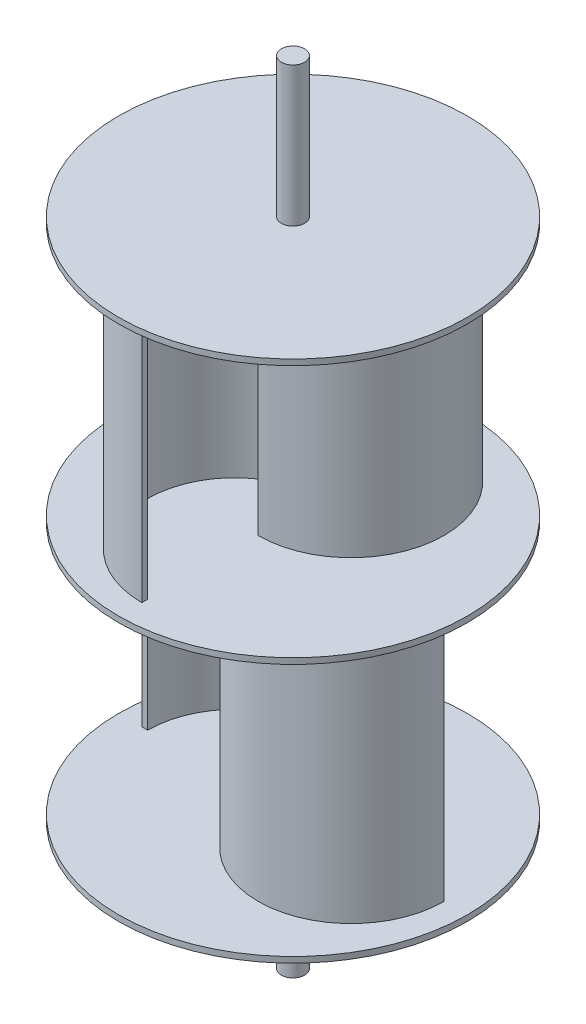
ISO-10303-21;
HEADER;
FILE_DESCRIPTION(('STEP AP214'),'2;1');
FILE_NAME('part.step','',(''),(''),'','','');
FILE_SCHEMA(('AUTOMOTIVE_DESIGN { 1 0 10303 214 1 1 1 1 }'));
ENDSEC;
DATA;
#1=APPLICATION_CONTEXT('core data for automotive mechanical design processes');
#2=APPLICATION_PROTOCOL_DEFINITION('international standard','automotive_design',2000,#1);
#3=PRODUCT_CONTEXT('',#1,'mechanical');
#4=PRODUCT('Part','Part','',(#3));
#5=PRODUCT_RELATED_PRODUCT_CATEGORY('part','',(#4));
#6=PRODUCT_DEFINITION_FORMATION('','',#4);
#7=PRODUCT_DEFINITION_CONTEXT('part definition',#1,'design');
#8=PRODUCT_DEFINITION('design','',#6,#7);
#9=PRODUCT_DEFINITION_SHAPE('','',#8);
#10=(LENGTH_UNIT() NAMED_UNIT(*) SI_UNIT(.MILLI.,.METRE.));
#11=(NAMED_UNIT(*) PLANE_ANGLE_UNIT() SI_UNIT($,.RADIAN.));
#12=(NAMED_UNIT(*) SI_UNIT($,.STERADIAN.) SOLID_ANGLE_UNIT());
#13=UNCERTAINTY_MEASURE_WITH_UNIT(LENGTH_MEASURE(1.E-05),#10,'distance_accuracy_value','');
#14=(GEOMETRIC_REPRESENTATION_CONTEXT(3) GLOBAL_UNCERTAINTY_ASSIGNED_CONTEXT((#13)) GLOBAL_UNIT_ASSIGNED_CONTEXT((#10,
#11,#12)) REPRESENTATION_CONTEXT('',''));
#15=CARTESIAN_POINT('',(0.,0.,0.));
#16=DIRECTION('',(0.,0.,1.));
#17=DIRECTION('',(1.,0.,0.));
#18=AXIS2_PLACEMENT_3D('',#15,#16,#17);
#19=CARTESIAN_POINT('',(0.,227.5,0.));
#20=DIRECTION('',(0.,1.,0.));
#21=DIRECTION('',(0.,0.,1.));
#22=AXIS2_PLACEMENT_3D('',#19,#20,#21);
#23=PLANE('',#22);
#24=CARTESIAN_POINT('',(0.,227.5,0.));
#25=DIRECTION('',(0.,1.,0.));
#26=DIRECTION('',(0.,0.,1.));
#27=AXIS2_PLACEMENT_3D('',#24,#25,#26);
#28=CIRCLE('',#27,10.);
#29=CARTESIAN_POINT('',(0.,227.5,-10.));
#30=VERTEX_POINT('',#29);
#31=EDGE_CURVE('E272',#30,#30,#28,.T.);
#32=ORIENTED_EDGE('',*,*,#31,.F.);
#33=EDGE_LOOP('',(#32));
#34=FACE_BOUND('',#33,.T.);
#35=CARTESIAN_POINT('',(0.,227.5,0.));
#36=DIRECTION('',(0.,1.,0.));
#37=DIRECTION('',(0.,0.,1.));
#38=AXIS2_PLACEMENT_3D('',#35,#36,#37);
#39=CIRCLE('',#38,150.);
#40=CARTESIAN_POINT('',(0.,227.5,150.));
#41=VERTEX_POINT('',#40);
#42=EDGE_CURVE('E269',#41,#41,#39,.T.);
#43=ORIENTED_EDGE('',*,*,#42,.T.);
#44=EDGE_LOOP('',(#43));
#45=FACE_BOUND('',#44,.T.);
#46=DIRECTION('',(0.,0.,-1.));
#47=VECTOR('',#46,1.);
#48=CARTESIAN_POINT('',(0.,227.5,-125.));
#49=LINE('',#48,#47);
#50=CARTESIAN_POINT('',(0.,227.5,-125.));
#51=VERTEX_POINT('',#50);
#52=CARTESIAN_POINT('',(0.,227.5,-130.));
#53=VERTEX_POINT('',#52);
#54=EDGE_CURVE('E252',#51,#53,#49,.T.);
#55=ORIENTED_EDGE('',*,*,#54,.T.);
#56=CARTESIAN_POINT('',(0.,227.5,-50.));
#57=DIRECTION('',(0.,1.,0.));
#58=DIRECTION('',(1.,0.,0.));
#59=AXIS2_PLACEMENT_3D('',#56,#57,#58);
#60=CIRCLE('',#59,80.);
#61=CARTESIAN_POINT('',(0.,227.5,30.));
#62=VERTEX_POINT('',#61);
#63=EDGE_CURVE('E236',#62,#53,#60,.T.);
#64=ORIENTED_EDGE('',*,*,#63,.F.);
#65=DIRECTION('',(0.,0.,-1.));
#66=VECTOR('',#65,1.);
#67=CARTESIAN_POINT('',(0.,227.5,30.));
#68=LINE('',#67,#66);
#69=CARTESIAN_POINT('',(0.,227.5,25.));
#70=VERTEX_POINT('',#69);
#71=EDGE_CURVE('E240',#62,#70,#68,.T.);
#72=ORIENTED_EDGE('',*,*,#71,.T.);
#73=CARTESIAN_POINT('',(0.,227.5,-50.));
#74=DIRECTION('',(0.,1.,0.));
#75=DIRECTION('',(0.,0.,1.));
#76=AXIS2_PLACEMENT_3D('',#73,#74,#75);
#77=CIRCLE('',#76,75.);
#78=EDGE_CURVE('E254',#70,#51,#77,.T.);
#79=ORIENTED_EDGE('',*,*,#78,.T.);
#80=EDGE_LOOP('',(#55,#64,#72,#79));
#81=FACE_BOUND('',#80,.T.);
#82=DIRECTION('',(0.,0.,1.));
#83=VECTOR('',#82,1.);
#84=CARTESIAN_POINT('',(0.,227.5,125.));
#85=LINE('',#84,#83);
#86=CARTESIAN_POINT('',(0.,227.5,125.));
#87=VERTEX_POINT('',#86);
#88=CARTESIAN_POINT('',(0.,227.5,130.));
#89=VERTEX_POINT('',#88);
#90=EDGE_CURVE('E97',#87,#89,#85,.T.);
#91=ORIENTED_EDGE('',*,*,#90,.T.);
#92=CARTESIAN_POINT('',(0.,227.5,50.));
#93=DIRECTION('',(0.,1.,0.));
#94=DIRECTION('',(1.,0.,0.));
#95=AXIS2_PLACEMENT_3D('',#92,#93,#94);
#96=CIRCLE('',#95,80.);
#97=CARTESIAN_POINT('',(0.,227.5,-30.));
#98=VERTEX_POINT('',#97);
#99=EDGE_CURVE('E227',#98,#89,#96,.T.);
#100=ORIENTED_EDGE('',*,*,#99,.F.);
#101=DIRECTION('',(0.,0.,1.));
#102=VECTOR('',#101,1.);
#103=CARTESIAN_POINT('',(0.,227.5,-30.));
#104=LINE('',#103,#102);
#105=CARTESIAN_POINT('',(0.,227.5,-25.));
#106=VERTEX_POINT('',#105);
#107=EDGE_CURVE('E210',#98,#106,#104,.T.);
#108=ORIENTED_EDGE('',*,*,#107,.T.);
#109=CARTESIAN_POINT('',(0.,227.5,50.));
#110=DIRECTION('',(0.,1.,0.));
#111=DIRECTION('',(0.,0.,1.));
#112=AXIS2_PLACEMENT_3D('',#109,#110,#111);
#113=CIRCLE('',#112,75.);
#114=EDGE_CURVE('E102',#106,#87,#113,.T.);
#115=ORIENTED_EDGE('',*,*,#114,.T.);
#116=EDGE_LOOP('',(#91,#100,#108,#115));
#117=FACE_BOUND('',#116,.T.);
#118=ADVANCED_FACE('F82',(#34,#45,#81,#117),#23,.T.);
#119=CARTESIAN_POINT('',(0.,440.,0.));
#120=DIRECTION('',(0.,-1.,0.));
#121=DIRECTION('',(0.,0.,-1.));
#122=AXIS2_PLACEMENT_3D('',#119,#120,#121);
#123=CYLINDRICAL_SURFACE('',#122,10.);
#124=CARTESIAN_POINT('',(0.,5.,0.));
#125=DIRECTION('',(0.,1.,0.));
#126=DIRECTION('',(0.,0.,1.));
#127=AXIS2_PLACEMENT_3D('',#124,#125,#126);
#128=CIRCLE('',#127,10.);
#129=CARTESIAN_POINT('',(0.,5.,-10.));
#130=VERTEX_POINT('',#129);
#131=EDGE_CURVE('E275',#130,#130,#128,.T.);
#132=CARTESIAN_POINT('',(0.,222.5,0.));
#133=DIRECTION('',(0.,1.,0.));
#134=DIRECTION('',(0.,0.,1.));
#135=AXIS2_PLACEMENT_3D('',#132,#133,#134);
#136=CIRCLE('',#135,10.);
#137=CARTESIAN_POINT('',(0.,222.5,-10.));
#138=VERTEX_POINT('',#137);
#139=EDGE_CURVE('E90',#138,#138,#136,.T.);
#140=CARTESIAN_POINT('',(0.,5.,-10.));
#141=CARTESIAN_POINT('',(0.,7.265625,-10.));
#142=CARTESIAN_POINT('',(0.,9.53124999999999,-10.));
#143=CARTESIAN_POINT('',(0.,14.0625,-10.));
#144=CARTESIAN_POINT('',(0.,16.328125,-10.));
#145=CARTESIAN_POINT('',(0.,20.859375,-10.));
#146=CARTESIAN_POINT('',(0.,23.125,-10.));
#147=CARTESIAN_POINT('',(0.,27.65625,-10.));
#148=CARTESIAN_POINT('',(0.,29.921875,-10.));
#149=CARTESIAN_POINT('',(0.,34.453125,-10.));
#150=CARTESIAN_POINT('',(0.,36.71875,-10.));
#151=CARTESIAN_POINT('',(0.,41.25,-10.));
#152=CARTESIAN_POINT('',(0.,43.515625,-10.));
#153=CARTESIAN_POINT('',(0.,48.046875,-10.));
#154=CARTESIAN_POINT('',(0.,50.3125,-10.));
#155=CARTESIAN_POINT('',(0.,54.84375,-10.));
#156=CARTESIAN_POINT('',(0.,57.109375,-10.));
#157=CARTESIAN_POINT('',(0.,61.640625,-10.));
#158=CARTESIAN_POINT('',(0.,63.90625,-10.));
#159=CARTESIAN_POINT('',(0.,68.4375,-10.));
#160=CARTESIAN_POINT('',(0.,70.703125,-10.));
#161=CARTESIAN_POINT('',(0.,75.234375,-10.));
#162=CARTESIAN_POINT('',(0.,77.5,-10.));
#163=CARTESIAN_POINT('',(0.,82.03125,-10.));
#164=CARTESIAN_POINT('',(0.,84.296875,-10.));
#165=CARTESIAN_POINT('',(0.,88.828125,-10.));
#166=CARTESIAN_POINT('',(0.,91.09375,-10.));
#167=CARTESIAN_POINT('',(0.,95.625,-10.));
#168=CARTESIAN_POINT('',(0.,97.890625,-10.));
#169=CARTESIAN_POINT('',(0.,102.421875,-10.));
#170=CARTESIAN_POINT('',(0.,104.6875,-10.));
#171=CARTESIAN_POINT('',(0.,109.21875,-10.));
#172=CARTESIAN_POINT('',(0.,111.484375,-10.));
#173=CARTESIAN_POINT('',(0.,116.015625,-10.));
#174=CARTESIAN_POINT('',(0.,118.28125,-10.));
#175=CARTESIAN_POINT('',(0.,122.8125,-10.));
#176=CARTESIAN_POINT('',(0.,125.078125,-10.));
#177=CARTESIAN_POINT('',(0.,129.609375,-10.));
#178=CARTESIAN_POINT('',(0.,131.875,-10.));
#179=CARTESIAN_POINT('',(0.,136.40625,-10.));
#180=CARTESIAN_POINT('',(0.,138.671875,-10.));
#181=CARTESIAN_POINT('',(0.,143.203125,-10.));
#182=CARTESIAN_POINT('',(0.,145.46875,-10.));
#183=CARTESIAN_POINT('',(0.,150.,-10.));
#184=CARTESIAN_POINT('',(0.,152.265625,-10.));
#185=CARTESIAN_POINT('',(0.,156.796875,-10.));
#186=CARTESIAN_POINT('',(0.,159.0625,-10.));
#187=CARTESIAN_POINT('',(0.,163.59375,-10.));
#188=CARTESIAN_POINT('',(0.,165.859375,-10.));
#189=CARTESIAN_POINT('',(0.,170.390625,-10.));
#190=CARTESIAN_POINT('',(0.,172.65625,-10.));
#191=CARTESIAN_POINT('',(0.,177.1875,-10.));
#192=CARTESIAN_POINT('',(0.,179.453125,-10.));
#193=CARTESIAN_POINT('',(0.,183.984375,-10.));
#194=CARTESIAN_POINT('',(0.,186.25,-10.));
#195=CARTESIAN_POINT('',(0.,190.78125,-10.));
#196=CARTESIAN_POINT('',(0.,193.046875,-10.));
#197=CARTESIAN_POINT('',(0.,197.578125,-10.));
#198=CARTESIAN_POINT('',(0.,199.84375,-10.));
#199=CARTESIAN_POINT('',(0.,204.375,-10.));
#200=CARTESIAN_POINT('',(0.,206.640625,-10.));
#201=CARTESIAN_POINT('',(0.,211.171875,-10.));
#202=CARTESIAN_POINT('',(0.,213.4375,-10.));
#203=CARTESIAN_POINT('',(0.,217.96875,-10.));
#204=CARTESIAN_POINT('',(0.,220.234375,-10.));
#205=CARTESIAN_POINT('',(0.,222.5,-10.));
#206=B_SPLINE_CURVE_WITH_KNOTS('',3,(#140,#141,#142,#143,#144,#145,#146,#147,#148,#149,#150,
#151,#152,#153,#154,#155,#156,#157,#158,#159,#160,#161,#162,#163,#164,#165,#166,#167,#168,#169,
#170,#171,#172,#173,#174,#175,#176,#177,#178,#179,#180,#181,#182,#183,#184,#185,#186,#187,#188,
#189,#190,#191,#192,#193,#194,#195,#196,#197,#198,#199,#200,#201,#202,#203,#204,#205),
.UNSPECIFIED.,.F.,.F.,(4,2,2,2,2,2,2,2,2,2,2,2,2,2,2,2,2,2,2,2,2,2,2,2,2,2,2,2,2,2,2,2,4),(0.,
6.79687499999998,13.59375,20.390625,27.1875,33.984375,40.78125,47.578125,54.375,61.171875,
67.96875,74.765625,81.5625,88.359375,95.15625,101.953125,108.75,115.546875,122.34375,129.140625,
135.9375,142.734375,149.53125,156.328125,163.125,169.921875,176.71875,183.515625,190.3125,
197.109375,203.90625,210.703125,217.5),.UNSPECIFIED.);
#207=EDGE_CURVE('BSEAM357',#130,#138,#206,.T.);
#208=ORIENTED_EDGE('',*,*,#131,.T.);
#209=ORIENTED_EDGE('',*,*,#139,.F.);
#210=ORIENTED_EDGE('',*,*,#207,.T.);
#211=ORIENTED_EDGE('',*,*,#207,.F.);
#212=EDGE_LOOP('',(#208,#210,#209,#211));
#213=FACE_BOUND('',#212,.T.);
#214=ADVANCED_FACE('F357',(#213),#123,.T.);
#215=CARTESIAN_POINT('',(0.,5.,0.));
#216=DIRECTION('',(0.,1.,0.));
#217=DIRECTION('',(0.,0.,1.));
#218=AXIS2_PLACEMENT_3D('',#215,#216,#217);
#219=PLANE('',#218);
#220=ORIENTED_EDGE('',*,*,#131,.F.);
#221=EDGE_LOOP('',(#220));
#222=FACE_BOUND('',#221,.T.);
#223=CARTESIAN_POINT('',(0.,5.,0.));
#224=DIRECTION('',(0.,1.,0.));
#225=DIRECTION('',(0.,0.,1.));
#226=AXIS2_PLACEMENT_3D('',#223,#224,#225);
#227=CIRCLE('',#226,150.);
#228=CARTESIAN_POINT('',(0.,5.,150.));
#229=VERTEX_POINT('',#228);
#230=EDGE_CURVE('E343',#229,#229,#227,.T.);
#231=ORIENTED_EDGE('',*,*,#230,.T.);
#232=EDGE_LOOP('',(#231));
#233=FACE_BOUND('',#232,.T.);
#234=DIRECTION('',(-1.,0.,0.));
#235=VECTOR('',#234,1.);
#236=CARTESIAN_POINT('',(-125.,5.,0.));
#237=LINE('',#236,#235);
#238=CARTESIAN_POINT('',(-125.,5.,0.));
#239=VERTEX_POINT('',#238);
#240=CARTESIAN_POINT('',(-130.,5.,0.));
#241=VERTEX_POINT('',#240);
#242=EDGE_CURVE('E326',#239,#241,#237,.T.);
#243=ORIENTED_EDGE('',*,*,#242,.T.);
#244=CARTESIAN_POINT('',(-50.,5.,0.));
#245=DIRECTION('',(0.,1.,0.));
#246=DIRECTION('',(1.,0.,0.));
#247=AXIS2_PLACEMENT_3D('',#244,#245,#246);
#248=CIRCLE('',#247,80.);
#249=CARTESIAN_POINT('',(30.,5.,0.));
#250=VERTEX_POINT('',#249);
#251=EDGE_CURVE('E301',#250,#241,#248,.T.);
#252=ORIENTED_EDGE('',*,*,#251,.F.);
#253=DIRECTION('',(-1.,0.,0.));
#254=VECTOR('',#253,1.);
#255=CARTESIAN_POINT('',(30.,5.,0.));
#256=LINE('',#255,#254);
#257=CARTESIAN_POINT('',(25.,5.,0.));
#258=VERTEX_POINT('',#257);
#259=EDGE_CURVE('E314',#250,#258,#256,.T.);
#260=ORIENTED_EDGE('',*,*,#259,.T.);
#261=CARTESIAN_POINT('',(-50.,5.,0.));
#262=DIRECTION('',(0.,1.,0.));
#263=DIRECTION('',(0.,0.,1.));
#264=AXIS2_PLACEMENT_3D('',#261,#262,#263);
#265=CIRCLE('',#264,75.);
#266=EDGE_CURVE('E328',#258,#239,#265,.T.);
#267=ORIENTED_EDGE('',*,*,#266,.T.);
#268=EDGE_LOOP('',(#243,#252,#260,#267));
#269=FACE_BOUND('',#268,.T.);
#270=DIRECTION('',(1.,0.,0.));
#271=VECTOR('',#270,1.);
#272=CARTESIAN_POINT('',(125.,5.,0.));
#273=LINE('',#272,#271);
#274=CARTESIAN_POINT('',(125.,5.,0.));
#275=VERTEX_POINT('',#274);
#276=CARTESIAN_POINT('',(130.,5.,0.));
#277=VERTEX_POINT('',#276);
#278=EDGE_CURVE('E296',#275,#277,#273,.T.);
#279=ORIENTED_EDGE('',*,*,#278,.T.);
#280=CARTESIAN_POINT('',(50.,5.,0.));
#281=DIRECTION('',(0.,1.,0.));
#282=DIRECTION('',(1.,0.,0.));
#283=AXIS2_PLACEMENT_3D('',#280,#281,#282);
#284=CIRCLE('',#283,80.);
#285=CARTESIAN_POINT('',(-30.,5.,0.));
#286=VERTEX_POINT('',#285);
#287=EDGE_CURVE('E298',#286,#277,#284,.T.);
#288=ORIENTED_EDGE('',*,*,#287,.F.);
#289=DIRECTION('',(1.,0.,0.));
#290=VECTOR('',#289,1.);
#291=CARTESIAN_POINT('',(-30.,5.,0.));
#292=LINE('',#291,#290);
#293=CARTESIAN_POINT('',(-25.,5.,0.));
#294=VERTEX_POINT('',#293);
#295=EDGE_CURVE('E291',#286,#294,#292,.T.);
#296=ORIENTED_EDGE('',*,*,#295,.T.);
#297=CARTESIAN_POINT('',(50.,5.,0.));
#298=DIRECTION('',(0.,1.,0.));
#299=DIRECTION('',(0.,0.,1.));
#300=AXIS2_PLACEMENT_3D('',#297,#298,#299);
#301=CIRCLE('',#300,75.);
#302=EDGE_CURVE('E293',#294,#275,#301,.T.);
#303=ORIENTED_EDGE('',*,*,#302,.T.);
#304=EDGE_LOOP('',(#279,#288,#296,#303));
#305=FACE_BOUND('',#304,.T.);
#306=ADVANCED_FACE('F455',(#222,#233,#269,#305),#219,.T.);
#307=CARTESIAN_POINT('',(0.,5.,0.));
#308=DIRECTION('',(0.,-1.,0.));
#309=DIRECTION('',(0.,0.,-1.));
#310=AXIS2_PLACEMENT_3D('',#307,#308,#309);
#311=CYLINDRICAL_SURFACE('',#310,150.);
#312=ORIENTED_EDGE('',*,*,#230,.F.);
#313=EDGE_LOOP('',(#312));
#314=FACE_BOUND('',#313,.T.);
#315=CARTESIAN_POINT('',(0.,0.,0.));
#316=DIRECTION('',(0.,1.,0.));
#317=DIRECTION('',(0.,0.,1.));
#318=AXIS2_PLACEMENT_3D('',#315,#316,#317);
#319=CIRCLE('',#318,150.);
#320=CARTESIAN_POINT('',(0.,0.,150.));
#321=VERTEX_POINT('',#320);
#322=EDGE_CURVE('E342',#321,#321,#319,.T.);
#323=ORIENTED_EDGE('',*,*,#322,.T.);
#324=EDGE_LOOP('',(#323));
#325=FACE_BOUND('',#324,.T.);
#326=ADVANCED_FACE('F84',(#314,#325),#311,.T.);
#327=CARTESIAN_POINT('',(0.,0.,0.));
#328=DIRECTION('',(0.,1.,0.));
#329=DIRECTION('',(0.,0.,1.));
#330=AXIS2_PLACEMENT_3D('',#327,#328,#329);
#331=PLANE('',#330);
#332=CARTESIAN_POINT('',(0.,0.,0.));
#333=DIRECTION('',(0.,1.,0.));
#334=DIRECTION('',(0.,0.,1.));
#335=AXIS2_PLACEMENT_3D('',#332,#333,#334);
#336=CIRCLE('',#335,10.);
#337=CARTESIAN_POINT('',(0.,0.,10.));
#338=VERTEX_POINT('',#337);
#339=EDGE_CURVE('E467',#338,#338,#336,.T.);
#340=ORIENTED_EDGE('',*,*,#339,.T.);
#341=EDGE_LOOP('',(#340));
#342=FACE_BOUND('',#341,.T.);
#343=ORIENTED_EDGE('',*,*,#322,.F.);
#344=EDGE_LOOP('',(#343));
#345=FACE_BOUND('',#344,.T.);
#346=ADVANCED_FACE('F453',(#342,#345),#331,.F.);
#347=CARTESIAN_POINT('',(-50.,222.5,0.));
#348=DIRECTION('',(0.,-1.,0.));
#349=DIRECTION('',(0.,0.,-1.));
#350=AXIS2_PLACEMENT_3D('',#347,#348,#349);
#351=CYLINDRICAL_SURFACE('',#350,80.);
#352=ORIENTED_EDGE('',*,*,#251,.T.);
#353=DIRECTION('',(0.,-1.,0.));
#354=VECTOR('',#353,1.);
#355=CARTESIAN_POINT('',(-130.,222.5,0.));
#356=LINE('',#355,#354);
#357=CARTESIAN_POINT('',(-130.,222.5,0.));
#358=VERTEX_POINT('',#357);
#359=EDGE_CURVE('E339',#358,#241,#356,.T.);
#360=ORIENTED_EDGE('',*,*,#359,.F.);
#361=CARTESIAN_POINT('',(-50.,222.5,0.));
#362=DIRECTION('',(0.,1.,0.));
#363=DIRECTION('',(1.,0.,0.));
#364=AXIS2_PLACEMENT_3D('',#361,#362,#363);
#365=CIRCLE('',#364,80.);
#366=CARTESIAN_POINT('',(30.,222.5,0.));
#367=VERTEX_POINT('',#366);
#368=EDGE_CURVE('E311',#367,#358,#365,.T.);
#369=ORIENTED_EDGE('',*,*,#368,.F.);
#370=DIRECTION('',(0.,-1.,0.));
#371=VECTOR('',#370,1.);
#372=CARTESIAN_POINT('',(30.,222.5,0.));
#373=LINE('',#372,#371);
#374=EDGE_CURVE('E323',#367,#250,#373,.T.);
#375=ORIENTED_EDGE('',*,*,#374,.T.);
#376=EDGE_LOOP('',(#352,#360,#369,#375));
#377=FACE_BOUND('',#376,.T.);
#378=ADVANCED_FACE('F449',(#377),#351,.T.);
#379=CARTESIAN_POINT('',(-125.,222.5,0.));
#380=DIRECTION('',(0.,0.,1.));
#381=DIRECTION('',(1.,0.,0.));
#382=AXIS2_PLACEMENT_3D('',#379,#380,#381);
#383=PLANE('',#382);
#384=ORIENTED_EDGE('',*,*,#242,.F.);
#385=DIRECTION('',(0.,-1.,0.));
#386=VECTOR('',#385,1.);
#387=CARTESIAN_POINT('',(-125.,222.5,0.));
#388=LINE('',#387,#386);
#389=CARTESIAN_POINT('',(-125.,222.5,0.));
#390=VERTEX_POINT('',#389);
#391=EDGE_CURVE('E336',#390,#239,#388,.T.);
#392=ORIENTED_EDGE('',*,*,#391,.F.);
#393=DIRECTION('',(-1.,0.,0.));
#394=VECTOR('',#393,1.);
#395=CARTESIAN_POINT('',(-125.,222.5,0.));
#396=LINE('',#395,#394);
#397=EDGE_CURVE('E313',#390,#358,#396,.T.);
#398=ORIENTED_EDGE('',*,*,#397,.T.);
#399=ORIENTED_EDGE('',*,*,#359,.T.);
#400=EDGE_LOOP('',(#384,#392,#398,#399));
#401=FACE_BOUND('',#400,.T.);
#402=ADVANCED_FACE('F445',(#401),#383,.T.);
#403=CARTESIAN_POINT('',(-50.,222.5,0.));
#404=DIRECTION('',(0.,-1.,0.));
#405=DIRECTION('',(0.,0.,-1.));
#406=AXIS2_PLACEMENT_3D('',#403,#404,#405);
#407=CYLINDRICAL_SURFACE('',#406,75.);
#408=ORIENTED_EDGE('',*,*,#266,.F.);
#409=DIRECTION('',(0.,-1.,0.));
#410=VECTOR('',#409,1.);
#411=CARTESIAN_POINT('',(25.,222.5,0.));
#412=LINE('',#411,#410);
#413=CARTESIAN_POINT('',(25.,222.5,0.));
#414=VERTEX_POINT('',#413);
#415=EDGE_CURVE('E333',#414,#258,#412,.T.);
#416=ORIENTED_EDGE('',*,*,#415,.F.);
#417=CARTESIAN_POINT('',(-50.,222.5,0.));
#418=DIRECTION('',(0.,1.,0.));
#419=DIRECTION('',(0.,0.,1.));
#420=AXIS2_PLACEMENT_3D('',#417,#418,#419);
#421=CIRCLE('',#420,75.);
#422=EDGE_CURVE('E317',#414,#390,#421,.T.);
#423=ORIENTED_EDGE('',*,*,#422,.T.);
#424=ORIENTED_EDGE('',*,*,#391,.T.);
#425=EDGE_LOOP('',(#408,#416,#423,#424));
#426=FACE_BOUND('',#425,.T.);
#427=ADVANCED_FACE('F441',(#426),#407,.F.);
#428=CARTESIAN_POINT('',(30.,222.5,0.));
#429=DIRECTION('',(0.,0.,1.));
#430=DIRECTION('',(1.,0.,0.));
#431=AXIS2_PLACEMENT_3D('',#428,#429,#430);
#432=PLANE('',#431);
#433=ORIENTED_EDGE('',*,*,#259,.F.);
#434=ORIENTED_EDGE('',*,*,#374,.F.);
#435=DIRECTION('',(-1.,0.,0.));
#436=VECTOR('',#435,1.);
#437=CARTESIAN_POINT('',(30.,222.5,0.));
#438=LINE('',#437,#436);
#439=EDGE_CURVE('E320',#367,#414,#438,.T.);
#440=ORIENTED_EDGE('',*,*,#439,.T.);
#441=ORIENTED_EDGE('',*,*,#415,.T.);
#442=EDGE_LOOP('',(#433,#434,#440,#441));
#443=FACE_BOUND('',#442,.T.);
#444=ADVANCED_FACE('F427',(#443),#432,.T.);
#445=CARTESIAN_POINT('',(50.,222.5,0.));
#446=DIRECTION('',(0.,-1.,0.));
#447=DIRECTION('',(0.,0.,-1.));
#448=AXIS2_PLACEMENT_3D('',#445,#446,#447);
#449=CYLINDRICAL_SURFACE('',#448,80.);
#450=ORIENTED_EDGE('',*,*,#287,.T.);
#451=DIRECTION('',(0.,-1.,0.));
#452=VECTOR('',#451,1.);
#453=CARTESIAN_POINT('',(130.,222.5,0.));
#454=LINE('',#453,#452);
#455=CARTESIAN_POINT('',(130.,222.5,0.));
#456=VERTEX_POINT('',#455);
#457=EDGE_CURVE('E278',#456,#277,#454,.T.);
#458=ORIENTED_EDGE('',*,*,#457,.F.);
#459=CARTESIAN_POINT('',(50.,222.5,0.));
#460=DIRECTION('',(0.,1.,0.));
#461=DIRECTION('',(1.,0.,0.));
#462=AXIS2_PLACEMENT_3D('',#459,#460,#461);
#463=CIRCLE('',#462,80.);
#464=CARTESIAN_POINT('',(-30.,222.5,0.));
#465=VERTEX_POINT('',#464);
#466=EDGE_CURVE('E294',#465,#456,#463,.T.);
#467=ORIENTED_EDGE('',*,*,#466,.F.);
#468=DIRECTION('',(0.,-1.,0.));
#469=VECTOR('',#468,1.);
#470=CARTESIAN_POINT('',(-30.,222.5,0.));
#471=LINE('',#470,#469);
#472=EDGE_CURVE('E287',#465,#286,#471,.T.);
#473=ORIENTED_EDGE('',*,*,#472,.T.);
#474=EDGE_LOOP('',(#450,#458,#467,#473));
#475=FACE_BOUND('',#474,.T.);
#476=ADVANCED_FACE('F423',(#475),#449,.T.);
#477=CARTESIAN_POINT('',(125.,222.5,0.));
#478=DIRECTION('',(0.,0.,-1.));
#479=DIRECTION('',(-1.,0.,0.));
#480=AXIS2_PLACEMENT_3D('',#477,#478,#479);
#481=PLANE('',#480);
#482=ORIENTED_EDGE('',*,*,#278,.F.);
#483=DIRECTION('',(0.,-1.,0.));
#484=VECTOR('',#483,1.);
#485=CARTESIAN_POINT('',(125.,222.5,0.));
#486=LINE('',#485,#484);
#487=CARTESIAN_POINT('',(125.,222.5,0.));
#488=VERTEX_POINT('',#487);
#489=EDGE_CURVE('E281',#488,#275,#486,.T.);
#490=ORIENTED_EDGE('',*,*,#489,.F.);
#491=DIRECTION('',(1.,0.,0.));
#492=VECTOR('',#491,1.);
#493=CARTESIAN_POINT('',(125.,222.5,0.));
#494=LINE('',#493,#492);
#495=EDGE_CURVE('E307',#488,#456,#494,.T.);
#496=ORIENTED_EDGE('',*,*,#495,.T.);
#497=ORIENTED_EDGE('',*,*,#457,.T.);
#498=EDGE_LOOP('',(#482,#490,#496,#497));
#499=FACE_BOUND('',#498,.T.);
#500=ADVANCED_FACE('F426',(#499),#481,.T.);
#501=CARTESIAN_POINT('',(50.,222.5,0.));
#502=DIRECTION('',(0.,-1.,0.));
#503=DIRECTION('',(0.,0.,-1.));
#504=AXIS2_PLACEMENT_3D('',#501,#502,#503);
#505=CYLINDRICAL_SURFACE('',#504,75.);
#506=ORIENTED_EDGE('',*,*,#302,.F.);
#507=DIRECTION('',(0.,-1.,0.));
#508=VECTOR('',#507,1.);
#509=CARTESIAN_POINT('',(-25.,222.5,0.));
#510=LINE('',#509,#508);
#511=CARTESIAN_POINT('',(-25.,222.5,0.));
#512=VERTEX_POINT('',#511);
#513=EDGE_CURVE('E284',#512,#294,#510,.T.);
#514=ORIENTED_EDGE('',*,*,#513,.F.);
#515=CARTESIAN_POINT('',(50.,222.5,0.));
#516=DIRECTION('',(0.,1.,0.));
#517=DIRECTION('',(0.,0.,1.));
#518=AXIS2_PLACEMENT_3D('',#515,#516,#517);
#519=CIRCLE('',#518,75.);
#520=EDGE_CURVE('E304',#512,#488,#519,.T.);
#521=ORIENTED_EDGE('',*,*,#520,.T.);
#522=ORIENTED_EDGE('',*,*,#489,.T.);
#523=EDGE_LOOP('',(#506,#514,#521,#522));
#524=FACE_BOUND('',#523,.T.);
#525=ADVANCED_FACE('F431',(#524),#505,.F.);
#526=CARTESIAN_POINT('',(-30.,222.5,0.));
#527=DIRECTION('',(0.,0.,-1.));
#528=DIRECTION('',(-1.,0.,0.));
#529=AXIS2_PLACEMENT_3D('',#526,#527,#528);
#530=PLANE('',#529);
#531=ORIENTED_EDGE('',*,*,#295,.F.);
#532=ORIENTED_EDGE('',*,*,#472,.F.);
#533=DIRECTION('',(1.,0.,0.));
#534=VECTOR('',#533,1.);
#535=CARTESIAN_POINT('',(-30.,222.5,0.));
#536=LINE('',#535,#534);
#537=EDGE_CURVE('E290',#465,#512,#536,.T.);
#538=ORIENTED_EDGE('',*,*,#537,.T.);
#539=ORIENTED_EDGE('',*,*,#513,.T.);
#540=EDGE_LOOP('',(#531,#532,#538,#539));
#541=FACE_BOUND('',#540,.T.);
#542=ADVANCED_FACE('F419',(#541),#530,.T.);
#543=CARTESIAN_POINT('',(0.,227.5,0.));
#544=DIRECTION('',(0.,-1.,0.));
#545=DIRECTION('',(0.,0.,-1.));
#546=AXIS2_PLACEMENT_3D('',#543,#544,#545);
#547=CYLINDRICAL_SURFACE('',#546,150.);
#548=ORIENTED_EDGE('',*,*,#42,.F.);
#549=EDGE_LOOP('',(#548));
#550=FACE_BOUND('',#549,.T.);
#551=CARTESIAN_POINT('',(0.,222.5,0.));
#552=DIRECTION('',(0.,1.,0.));
#553=DIRECTION('',(0.,0.,1.));
#554=AXIS2_PLACEMENT_3D('',#551,#552,#553);
#555=CIRCLE('',#554,150.);
#556=CARTESIAN_POINT('',(0.,222.5,150.));
#557=VERTEX_POINT('',#556);
#558=EDGE_CURVE('E268',#557,#557,#555,.T.);
#559=ORIENTED_EDGE('',*,*,#558,.T.);
#560=EDGE_LOOP('',(#559));
#561=FACE_BOUND('',#560,.T.);
#562=ADVANCED_FACE('F415',(#550,#561),#547,.T.);
#563=CARTESIAN_POINT('',(0.,222.5,0.));
#564=DIRECTION('',(0.,1.,0.));
#565=DIRECTION('',(0.,0.,1.));
#566=AXIS2_PLACEMENT_3D('',#563,#564,#565);
#567=PLANE('',#566);
#568=ORIENTED_EDGE('',*,*,#439,.F.);
#569=ORIENTED_EDGE('',*,*,#368,.T.);
#570=ORIENTED_EDGE('',*,*,#397,.F.);
#571=ORIENTED_EDGE('',*,*,#422,.F.);
#572=EDGE_LOOP('',(#568,#569,#570,#571));
#573=FACE_BOUND('',#572,.T.);
#574=ORIENTED_EDGE('',*,*,#537,.F.);
#575=ORIENTED_EDGE('',*,*,#466,.T.);
#576=ORIENTED_EDGE('',*,*,#495,.F.);
#577=ORIENTED_EDGE('',*,*,#520,.F.);
#578=EDGE_LOOP('',(#574,#575,#576,#577));
#579=FACE_BOUND('',#578,.T.);
#580=ORIENTED_EDGE('',*,*,#139,.T.);
#581=EDGE_LOOP('',(#580));
#582=FACE_BOUND('',#581,.T.);
#583=ORIENTED_EDGE('',*,*,#558,.F.);
#584=EDGE_LOOP('',(#583));
#585=FACE_BOUND('',#584,.T.);
#586=ADVANCED_FACE('F412',(#573,#579,#582,#585),#567,.F.);
#587=CARTESIAN_POINT('',(0.,445.,0.));
#588=DIRECTION('',(0.,1.,0.));
#589=DIRECTION('',(0.,0.,1.));
#590=AXIS2_PLACEMENT_3D('',#587,#588,#589);
#591=CIRCLE('',#590,10.);
#592=CARTESIAN_POINT('',(0.,445.,-10.));
#593=VERTEX_POINT('',#592);
#594=EDGE_CURVE('E471',#593,#593,#591,.T.);
#595=CARTESIAN_POINT('',(0.,227.5,-10.));
#596=CARTESIAN_POINT('',(0.,229.765625,-10.));
#597=CARTESIAN_POINT('',(0.,232.03125,-10.));
#598=CARTESIAN_POINT('',(0.,236.5625,-10.));
#599=CARTESIAN_POINT('',(0.,238.828125,-10.));
#600=CARTESIAN_POINT('',(0.,243.359375,-10.));
#601=CARTESIAN_POINT('',(0.,245.625,-10.));
#602=CARTESIAN_POINT('',(0.,250.15625,-10.));
#603=CARTESIAN_POINT('',(0.,252.421875,-10.));
#604=CARTESIAN_POINT('',(0.,256.953125,-10.));
#605=CARTESIAN_POINT('',(0.,259.21875,-10.));
#606=CARTESIAN_POINT('',(0.,263.75,-10.));
#607=CARTESIAN_POINT('',(0.,266.015625,-10.));
#608=CARTESIAN_POINT('',(0.,270.546875,-10.));
#609=CARTESIAN_POINT('',(0.,272.8125,-10.));
#610=CARTESIAN_POINT('',(0.,277.34375,-10.));
#611=CARTESIAN_POINT('',(0.,279.609375,-10.));
#612=CARTESIAN_POINT('',(0.,284.140625,-10.));
#613=CARTESIAN_POINT('',(0.,286.40625,-10.));
#614=CARTESIAN_POINT('',(0.,290.9375,-10.));
#615=CARTESIAN_POINT('',(0.,293.203125,-10.));
#616=CARTESIAN_POINT('',(0.,297.734375,-10.));
#617=CARTESIAN_POINT('',(0.,300.,-10.));
#618=CARTESIAN_POINT('',(0.,304.53125,-10.));
#619=CARTESIAN_POINT('',(0.,306.796875,-10.));
#620=CARTESIAN_POINT('',(0.,311.328125,-10.));
#621=CARTESIAN_POINT('',(0.,313.59375,-10.));
#622=CARTESIAN_POINT('',(0.,318.125,-10.));
#623=CARTESIAN_POINT('',(0.,320.390625,-10.));
#624=CARTESIAN_POINT('',(0.,324.921875,-10.));
#625=CARTESIAN_POINT('',(0.,327.1875,-10.));
#626=CARTESIAN_POINT('',(0.,331.71875,-10.));
#627=CARTESIAN_POINT('',(0.,333.984375,-10.));
#628=CARTESIAN_POINT('',(0.,338.515625,-10.));
#629=CARTESIAN_POINT('',(0.,340.78125,-10.));
#630=CARTESIAN_POINT('',(0.,345.3125,-10.));
#631=CARTESIAN_POINT('',(0.,347.578125,-10.));
#632=CARTESIAN_POINT('',(0.,352.109375,-10.));
#633=CARTESIAN_POINT('',(0.,354.375,-10.));
#634=CARTESIAN_POINT('',(0.,358.90625,-10.));
#635=CARTESIAN_POINT('',(0.,361.171875,-10.));
#636=CARTESIAN_POINT('',(0.,365.703125,-10.));
#637=CARTESIAN_POINT('',(0.,367.96875,-10.));
#638=CARTESIAN_POINT('',(0.,372.5,-10.));
#639=CARTESIAN_POINT('',(0.,374.765625,-10.));
#640=CARTESIAN_POINT('',(0.,379.296875,-10.));
#641=CARTESIAN_POINT('',(0.,381.5625,-10.));
#642=CARTESIAN_POINT('',(0.,386.09375,-10.));
#643=CARTESIAN_POINT('',(0.,388.359375,-10.));
#644=CARTESIAN_POINT('',(0.,392.890625,-10.));
#645=CARTESIAN_POINT('',(0.,395.15625,-10.));
#646=CARTESIAN_POINT('',(0.,399.6875,-10.));
#647=CARTESIAN_POINT('',(0.,401.953125,-10.));
#648=CARTESIAN_POINT('',(0.,406.484375,-10.));
#649=CARTESIAN_POINT('',(0.,408.75,-10.));
#650=CARTESIAN_POINT('',(0.,413.28125,-10.));
#651=CARTESIAN_POINT('',(0.,415.546875,-10.));
#652=CARTESIAN_POINT('',(0.,420.078125,-10.));
#653=CARTESIAN_POINT('',(0.,422.34375,-10.));
#654=CARTESIAN_POINT('',(0.,426.875,-10.));
#655=CARTESIAN_POINT('',(0.,429.140625,-10.));
#656=CARTESIAN_POINT('',(0.,433.671875,-10.));
#657=CARTESIAN_POINT('',(0.,435.9375,-10.));
#658=CARTESIAN_POINT('',(0.,440.46875,-10.));
#659=CARTESIAN_POINT('',(0.,442.734375,-10.));
#660=CARTESIAN_POINT('',(0.,445.,-10.));
#661=B_SPLINE_CURVE_WITH_KNOTS('',3,(#595,#596,#597,#598,#599,#600,#601,#602,#603,#604,#605,
#606,#607,#608,#609,#610,#611,#612,#613,#614,#615,#616,#617,#618,#619,#620,#621,#622,#623,#624,
#625,#626,#627,#628,#629,#630,#631,#632,#633,#634,#635,#636,#637,#638,#639,#640,#641,#642,#643,
#644,#645,#646,#647,#648,#649,#650,#651,#652,#653,#654,#655,#656,#657,#658,#659,#660),
.UNSPECIFIED.,.F.,.F.,(4,2,2,2,2,2,2,2,2,2,2,2,2,2,2,2,2,2,2,2,2,2,2,2,2,2,2,2,2,2,2,2,4),(0.,
6.79687500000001,13.59375,20.390625,27.1875,33.984375,40.78125,47.578125,54.375,61.171875,
67.96875,74.765625,81.5625,88.359375,95.15625,101.953125,108.75,115.546875,122.34375,129.140625,
135.9375,142.734375,149.53125,156.328125,163.125,169.921875,176.71875,183.515625,190.3125,
197.109375,203.90625,210.703125,217.5),.UNSPECIFIED.);
#662=EDGE_CURVE('BSEAM352',#30,#593,#661,.T.);
#663=ORIENTED_EDGE('',*,*,#31,.T.);
#664=ORIENTED_EDGE('',*,*,#594,.F.);
#665=ORIENTED_EDGE('',*,*,#662,.T.);
#666=ORIENTED_EDGE('',*,*,#662,.F.);
#667=EDGE_LOOP('',(#663,#665,#664,#666));
#668=FACE_BOUND('',#667,.T.);
#669=ADVANCED_FACE('F352',(#668),#123,.T.);
#670=CARTESIAN_POINT('',(0.,445.,-50.));
#671=DIRECTION('',(0.,-1.,0.));
#672=DIRECTION('',(0.,0.,-1.));
#673=AXIS2_PLACEMENT_3D('',#670,#671,#672);
#674=CYLINDRICAL_SURFACE('',#673,80.);
#675=ORIENTED_EDGE('',*,*,#63,.T.);
#676=DIRECTION('',(0.,-1.,0.));
#677=VECTOR('',#676,1.);
#678=CARTESIAN_POINT('',(0.,445.,-130.));
#679=LINE('',#678,#677);
#680=CARTESIAN_POINT('',(0.,445.,-130.));
#681=VERTEX_POINT('',#680);
#682=EDGE_CURVE('E265',#681,#53,#679,.T.);
#683=ORIENTED_EDGE('',*,*,#682,.F.);
#684=CARTESIAN_POINT('',(0.,445.,-50.));
#685=DIRECTION('',(0.,1.,0.));
#686=DIRECTION('',(1.,0.,0.));
#687=AXIS2_PLACEMENT_3D('',#684,#685,#686);
#688=CIRCLE('',#687,80.);
#689=CARTESIAN_POINT('',(0.,445.,30.));
#690=VERTEX_POINT('',#689);
#691=EDGE_CURVE('E237',#690,#681,#688,.T.);
#692=ORIENTED_EDGE('',*,*,#691,.F.);
#693=DIRECTION('',(0.,-1.,0.));
#694=VECTOR('',#693,1.);
#695=CARTESIAN_POINT('',(0.,445.,30.));
#696=LINE('',#695,#694);
#697=EDGE_CURVE('E249',#690,#62,#696,.T.);
#698=ORIENTED_EDGE('',*,*,#697,.T.);
#699=EDGE_LOOP('',(#675,#683,#692,#698));
#700=FACE_BOUND('',#699,.T.);
#701=ADVANCED_FACE('F369',(#700),#674,.T.);
#702=CARTESIAN_POINT('',(0.,445.,-125.));
#703=DIRECTION('',(-1.,0.,0.));
#704=DIRECTION('',(0.,0.,1.));
#705=AXIS2_PLACEMENT_3D('',#702,#703,#704);
#706=PLANE('',#705);
#707=ORIENTED_EDGE('',*,*,#54,.F.);
#708=DIRECTION('',(0.,-1.,0.));
#709=VECTOR('',#708,1.);
#710=CARTESIAN_POINT('',(0.,445.,-125.));
#711=LINE('',#710,#709);
#712=CARTESIAN_POINT('',(0.,445.,-125.));
#713=VERTEX_POINT('',#712);
#714=EDGE_CURVE('E262',#713,#51,#711,.T.);
#715=ORIENTED_EDGE('',*,*,#714,.F.);
#716=DIRECTION('',(0.,0.,-1.));
#717=VECTOR('',#716,1.);
#718=CARTESIAN_POINT('',(0.,445.,-125.));
#719=LINE('',#718,#717);
#720=EDGE_CURVE('E239',#713,#681,#719,.T.);
#721=ORIENTED_EDGE('',*,*,#720,.T.);
#722=ORIENTED_EDGE('',*,*,#682,.T.);
#723=EDGE_LOOP('',(#707,#715,#721,#722));
#724=FACE_BOUND('',#723,.T.);
#725=ADVANCED_FACE('F366',(#724),#706,.T.);
#726=CARTESIAN_POINT('',(0.,445.,-50.));
#727=DIRECTION('',(0.,-1.,0.));
#728=DIRECTION('',(0.,0.,-1.));
#729=AXIS2_PLACEMENT_3D('',#726,#727,#728);
#730=CYLINDRICAL_SURFACE('',#729,75.);
#731=ORIENTED_EDGE('',*,*,#78,.F.);
#732=DIRECTION('',(0.,-1.,0.));
#733=VECTOR('',#732,1.);
#734=CARTESIAN_POINT('',(0.,445.,25.));
#735=LINE('',#734,#733);
#736=CARTESIAN_POINT('',(0.,445.,25.));
#737=VERTEX_POINT('',#736);
#738=EDGE_CURVE('E259',#737,#70,#735,.T.);
#739=ORIENTED_EDGE('',*,*,#738,.F.);
#740=CARTESIAN_POINT('',(0.,445.,-50.));
#741=DIRECTION('',(0.,1.,0.));
#742=DIRECTION('',(0.,0.,1.));
#743=AXIS2_PLACEMENT_3D('',#740,#741,#742);
#744=CIRCLE('',#743,75.);
#745=EDGE_CURVE('E243',#737,#713,#744,.T.);
#746=ORIENTED_EDGE('',*,*,#745,.T.);
#747=ORIENTED_EDGE('',*,*,#714,.T.);
#748=EDGE_LOOP('',(#731,#739,#746,#747));
#749=FACE_BOUND('',#748,.T.);
#750=ADVANCED_FACE('F376',(#749),#730,.F.);
#751=CARTESIAN_POINT('',(0.,445.,30.));
#752=DIRECTION('',(-1.,0.,0.));
#753=DIRECTION('',(0.,0.,1.));
#754=AXIS2_PLACEMENT_3D('',#751,#752,#753);
#755=PLANE('',#754);
#756=ORIENTED_EDGE('',*,*,#71,.F.);
#757=ORIENTED_EDGE('',*,*,#697,.F.);
#758=DIRECTION('',(0.,0.,-1.));
#759=VECTOR('',#758,1.);
#760=CARTESIAN_POINT('',(0.,445.,30.));
#761=LINE('',#760,#759);
#762=EDGE_CURVE('E246',#690,#737,#761,.T.);
#763=ORIENTED_EDGE('',*,*,#762,.T.);
#764=ORIENTED_EDGE('',*,*,#738,.T.);
#765=EDGE_LOOP('',(#756,#757,#763,#764));
#766=FACE_BOUND('',#765,.T.);
#767=ADVANCED_FACE('F373',(#766),#755,.T.);
#768=CARTESIAN_POINT('',(0.,445.,50.));
#769=DIRECTION('',(0.,-1.,0.));
#770=DIRECTION('',(0.,0.,-1.));
#771=AXIS2_PLACEMENT_3D('',#768,#769,#770);
#772=CYLINDRICAL_SURFACE('',#771,80.);
#773=ORIENTED_EDGE('',*,*,#99,.T.);
#774=DIRECTION('',(0.,-1.,0.));
#775=VECTOR('',#774,1.);
#776=CARTESIAN_POINT('',(0.,445.,130.));
#777=LINE('',#776,#775);
#778=CARTESIAN_POINT('',(0.,445.,130.));
#779=VERTEX_POINT('',#778);
#780=EDGE_CURVE('E216',#779,#89,#777,.T.);
#781=ORIENTED_EDGE('',*,*,#780,.F.);
#782=CARTESIAN_POINT('',(0.,445.,50.));
#783=DIRECTION('',(0.,1.,0.));
#784=DIRECTION('',(1.,0.,0.));
#785=AXIS2_PLACEMENT_3D('',#782,#783,#784);
#786=CIRCLE('',#785,80.);
#787=CARTESIAN_POINT('',(0.,445.,-30.));
#788=VERTEX_POINT('',#787);
#789=EDGE_CURVE('E198',#788,#779,#786,.T.);
#790=ORIENTED_EDGE('',*,*,#789,.F.);
#791=DIRECTION('',(0.,-1.,0.));
#792=VECTOR('',#791,1.);
#793=CARTESIAN_POINT('',(0.,445.,-30.));
#794=LINE('',#793,#792);
#795=EDGE_CURVE('E205',#788,#98,#794,.T.);
#796=ORIENTED_EDGE('',*,*,#795,.T.);
#797=EDGE_LOOP('',(#773,#781,#790,#796));
#798=FACE_BOUND('',#797,.T.);
#799=ADVANCED_FACE('F215',(#798),#772,.T.);
#800=CARTESIAN_POINT('',(0.,445.,125.));
#801=DIRECTION('',(1.,0.,0.));
#802=DIRECTION('',(0.,0.,-1.));
#803=AXIS2_PLACEMENT_3D('',#800,#801,#802);
#804=PLANE('',#803);
#805=ORIENTED_EDGE('',*,*,#90,.F.);
#806=DIRECTION('',(0.,-1.,0.));
#807=VECTOR('',#806,1.);
#808=CARTESIAN_POINT('',(0.,445.,125.));
#809=LINE('',#808,#807);
#810=CARTESIAN_POINT('',(0.,445.,125.));
#811=VERTEX_POINT('',#810);
#812=EDGE_CURVE('E233',#811,#87,#809,.T.);
#813=ORIENTED_EDGE('',*,*,#812,.F.);
#814=DIRECTION('',(0.,0.,1.));
#815=VECTOR('',#814,1.);
#816=CARTESIAN_POINT('',(0.,445.,125.));
#817=LINE('',#816,#815);
#818=EDGE_CURVE('E218',#811,#779,#817,.T.);
#819=ORIENTED_EDGE('',*,*,#818,.T.);
#820=ORIENTED_EDGE('',*,*,#780,.T.);
#821=EDGE_LOOP('',(#805,#813,#819,#820));
#822=FACE_BOUND('',#821,.T.);
#823=ADVANCED_FACE('F397',(#822),#804,.T.);
#824=CARTESIAN_POINT('',(0.,445.,50.));
#825=DIRECTION('',(0.,-1.,0.));
#826=DIRECTION('',(0.,0.,-1.));
#827=AXIS2_PLACEMENT_3D('',#824,#825,#826);
#828=CYLINDRICAL_SURFACE('',#827,75.);
#829=ORIENTED_EDGE('',*,*,#114,.F.);
#830=DIRECTION('',(0.,-1.,0.));
#831=VECTOR('',#830,1.);
#832=CARTESIAN_POINT('',(0.,445.,-25.));
#833=LINE('',#832,#831);
#834=CARTESIAN_POINT('',(0.,445.,-25.));
#835=VERTEX_POINT('',#834);
#836=EDGE_CURVE('E213',#835,#106,#833,.T.);
#837=ORIENTED_EDGE('',*,*,#836,.F.);
#838=CARTESIAN_POINT('',(0.,445.,50.));
#839=DIRECTION('',(0.,1.,0.));
#840=DIRECTION('',(0.,0.,1.));
#841=AXIS2_PLACEMENT_3D('',#838,#839,#840);
#842=CIRCLE('',#841,75.);
#843=EDGE_CURVE('E201',#835,#811,#842,.T.);
#844=ORIENTED_EDGE('',*,*,#843,.T.);
#845=ORIENTED_EDGE('',*,*,#812,.T.);
#846=EDGE_LOOP('',(#829,#837,#844,#845));
#847=FACE_BOUND('',#846,.T.);
#848=ADVANCED_FACE('F388',(#847),#828,.F.);
#849=CARTESIAN_POINT('',(0.,445.,-30.));
#850=DIRECTION('',(1.,0.,0.));
#851=DIRECTION('',(0.,0.,-1.));
#852=AXIS2_PLACEMENT_3D('',#849,#850,#851);
#853=PLANE('',#852);
#854=ORIENTED_EDGE('',*,*,#107,.F.);
#855=ORIENTED_EDGE('',*,*,#795,.F.);
#856=DIRECTION('',(0.,0.,1.));
#857=VECTOR('',#856,1.);
#858=CARTESIAN_POINT('',(0.,445.,-30.));
#859=LINE('',#858,#857);
#860=EDGE_CURVE('E193',#788,#835,#859,.T.);
#861=ORIENTED_EDGE('',*,*,#860,.T.);
#862=ORIENTED_EDGE('',*,*,#836,.T.);
#863=EDGE_LOOP('',(#854,#855,#861,#862));
#864=FACE_BOUND('',#863,.T.);
#865=ADVANCED_FACE('F209',(#864),#853,.T.);
#866=CARTESIAN_POINT('',(0.,445.,0.));
#867=DIRECTION('',(0.,1.,0.));
#868=DIRECTION('',(0.,0.,1.));
#869=AXIS2_PLACEMENT_3D('',#866,#867,#868);
#870=PLANE('',#869);
#871=ORIENTED_EDGE('',*,*,#594,.T.);
#872=EDGE_LOOP('',(#871));
#873=FACE_BOUND('',#872,.T.);
#874=CARTESIAN_POINT('',(0.,445.,0.));
#875=DIRECTION('',(0.,1.,0.));
#876=DIRECTION('',(0.,0.,1.));
#877=AXIS2_PLACEMENT_3D('',#874,#875,#876);
#878=CIRCLE('',#877,150.);
#879=CARTESIAN_POINT('',(0.,445.,150.));
#880=VERTEX_POINT('',#879);
#881=EDGE_CURVE('E223',#880,#880,#878,.T.);
#882=ORIENTED_EDGE('',*,*,#881,.F.);
#883=EDGE_LOOP('',(#882));
#884=FACE_BOUND('',#883,.T.);
#885=ORIENTED_EDGE('',*,*,#860,.F.);
#886=ORIENTED_EDGE('',*,*,#789,.T.);
#887=ORIENTED_EDGE('',*,*,#818,.F.);
#888=ORIENTED_EDGE('',*,*,#843,.F.);
#889=EDGE_LOOP('',(#885,#886,#887,#888));
#890=FACE_BOUND('',#889,.T.);
#891=ORIENTED_EDGE('',*,*,#762,.F.);
#892=ORIENTED_EDGE('',*,*,#691,.T.);
#893=ORIENTED_EDGE('',*,*,#720,.F.);
#894=ORIENTED_EDGE('',*,*,#745,.F.);
#895=EDGE_LOOP('',(#891,#892,#893,#894));
#896=FACE_BOUND('',#895,.T.);
#897=ADVANCED_FACE('F195',(#873,#884,#890,#896),#870,.F.);
#898=CARTESIAN_POINT('',(0.,450.,0.));
#899=DIRECTION('',(0.,-1.,0.));
#900=DIRECTION('',(0.,0.,-1.));
#901=AXIS2_PLACEMENT_3D('',#898,#899,#900);
#902=CYLINDRICAL_SURFACE('',#901,150.);
#903=CARTESIAN_POINT('',(0.,450.,0.));
#904=DIRECTION('',(0.,1.,0.));
#905=DIRECTION('',(0.,0.,1.));
#906=AXIS2_PLACEMENT_3D('',#903,#904,#905);
#907=CIRCLE('',#906,150.);
#908=CARTESIAN_POINT('',(0.,450.,150.));
#909=VERTEX_POINT('',#908);
#910=EDGE_CURVE('E229',#909,#909,#907,.T.);
#911=ORIENTED_EDGE('',*,*,#910,.F.);
#912=EDGE_LOOP('',(#911));
#913=FACE_BOUND('',#912,.T.);
#914=ORIENTED_EDGE('',*,*,#881,.T.);
#915=EDGE_LOOP('',(#914));
#916=FACE_BOUND('',#915,.T.);
#917=ADVANCED_FACE('F378',(#913,#916),#902,.T.);
#918=CARTESIAN_POINT('',(0.,450.,0.));
#919=DIRECTION('',(0.,1.,0.));
#920=DIRECTION('',(0.,0.,1.));
#921=AXIS2_PLACEMENT_3D('',#918,#919,#920);
#922=PLANE('',#921);
#923=CARTESIAN_POINT('',(0.,450.,0.));
#924=DIRECTION('',(0.,1.,0.));
#925=DIRECTION('',(0.,0.,1.));
#926=AXIS2_PLACEMENT_3D('',#923,#924,#925);
#927=CIRCLE('',#926,10.);
#928=CARTESIAN_POINT('',(0.,450.,10.));
#929=VERTEX_POINT('',#928);
#930=EDGE_CURVE('E12',#929,#929,#927,.T.);
#931=ORIENTED_EDGE('',*,*,#930,.F.);
#932=EDGE_LOOP('',(#931));
#933=FACE_BOUND('',#932,.T.);
#934=ORIENTED_EDGE('',*,*,#910,.T.);
#935=EDGE_LOOP('',(#934));
#936=FACE_BOUND('',#935,.T.);
#937=ADVANCED_FACE('F385',(#933,#936),#922,.T.);
#938=CARTESIAN_POINT('',(0.,570.,0.));
#939=DIRECTION('',(0.,1.,0.));
#940=DIRECTION('',(0.,0.,1.));
#941=AXIS2_PLACEMENT_3D('',#938,#939,#940);
#942=PLANE('',#941);
#943=CARTESIAN_POINT('',(0.,570.,0.));
#944=DIRECTION('',(0.,1.,0.));
#945=DIRECTION('',(0.,0.,1.));
#946=AXIS2_PLACEMENT_3D('',#943,#944,#945);
#947=CIRCLE('',#946,10.);
#948=CARTESIAN_POINT('',(0.,570.,10.));
#949=VERTEX_POINT('',#948);
#950=EDGE_CURVE('E498',#949,#949,#947,.T.);
#951=ORIENTED_EDGE('',*,*,#950,.T.);
#952=EDGE_LOOP('',(#951));
#953=FACE_BOUND('',#952,.T.);
#954=ADVANCED_FACE('F483',(#953),#942,.T.);
#955=CARTESIAN_POINT('',(0.,-110.,0.));
#956=DIRECTION('',(0.,1.,0.));
#957=DIRECTION('',(0.,0.,1.));
#958=AXIS2_PLACEMENT_3D('',#955,#956,#957);
#959=CYLINDRICAL_SURFACE('',#958,10.);
#960=ORIENTED_EDGE('',*,*,#930,.T.);
#961=EDGE_LOOP('',(#960));
#962=FACE_BOUND('',#961,.T.);
#963=ORIENTED_EDGE('',*,*,#950,.F.);
#964=EDGE_LOOP('',(#963));
#965=FACE_BOUND('',#964,.T.);
#966=ADVANCED_FACE('F488',(#962,#965),#959,.T.);
#967=CARTESIAN_POINT('',(0.,-110.,0.));
#968=DIRECTION('',(0.,1.,0.));
#969=DIRECTION('',(0.,0.,1.));
#970=AXIS2_PLACEMENT_3D('',#967,#968,#969);
#971=CIRCLE('',#970,10.);
#972=CARTESIAN_POINT('',(0.,-110.,10.));
#973=VERTEX_POINT('',#972);
#974=EDGE_CURVE('E474',#973,#973,#971,.T.);
#975=ORIENTED_EDGE('',*,*,#974,.T.);
#976=EDGE_LOOP('',(#975));
#977=FACE_BOUND('',#976,.T.);
#978=ORIENTED_EDGE('',*,*,#339,.F.);
#979=EDGE_LOOP('',(#978));
#980=FACE_BOUND('',#979,.T.);
#981=ADVANCED_FACE('F495',(#977,#980),#959,.T.);
#982=CARTESIAN_POINT('',(0.,-110.,0.));
#983=DIRECTION('',(0.,1.,0.));
#984=DIRECTION('',(0.,0.,1.));
#985=AXIS2_PLACEMENT_3D('',#982,#983,#984);
#986=PLANE('',#985);
#987=ORIENTED_EDGE('',*,*,#974,.F.);
#988=EDGE_LOOP('',(#987));
#989=FACE_BOUND('',#988,.T.);
#990=ADVANCED_FACE('F504',(#989),#986,.F.);
#991=CLOSED_SHELL('',(#118,#214,#306,#326,#346,#378,#402,#427,#444,#476,#500,#525,#542,#562,
#586,#669,#701,#725,#750,#767,#799,#823,#848,#865,#897,#917,#937,#954,#966,#981,#990));
#992=MANIFOLD_SOLID_BREP('B2',#991);
#993=ADVANCED_BREP_SHAPE_REPRESENTATION('',(#18,#992),#14);
#994=SHAPE_DEFINITION_REPRESENTATION(#9,#993);
ENDSEC;
END-ISO-10303-21;
